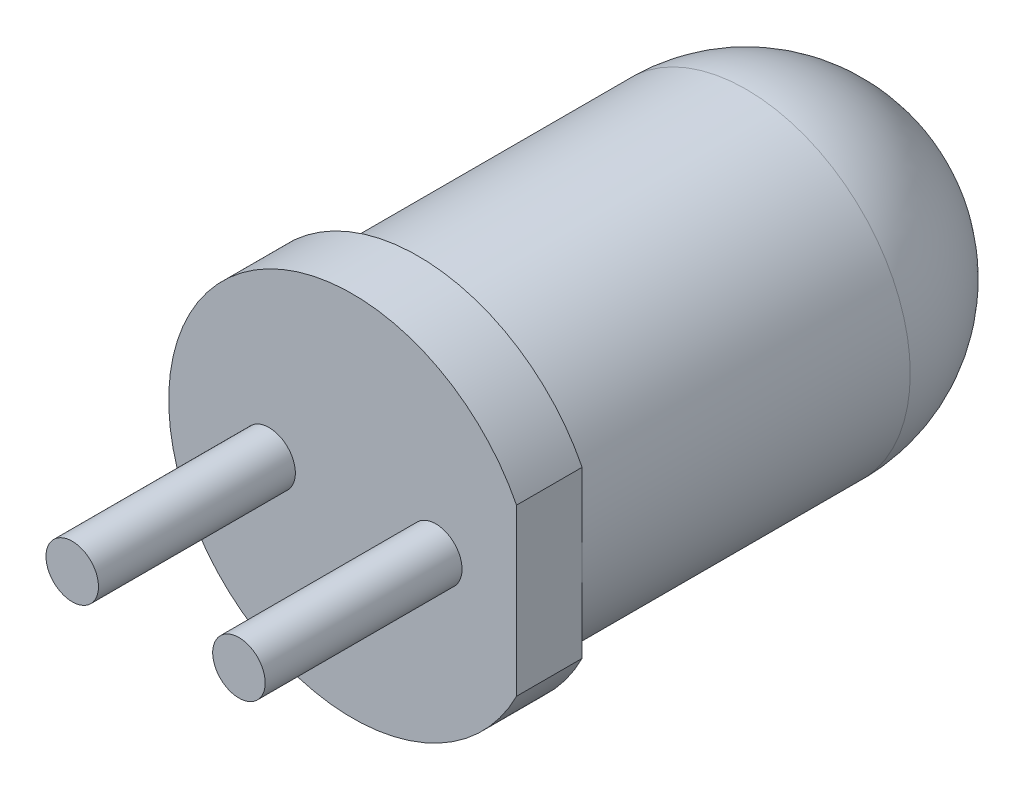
from build123d import *

# Parameters (mm, degrees)
ESQUISSE1_R          = 2.5
BASE_EXTRUSION_DEPTH = 8.5
BOSS_EXTRU_1_DEPTH   = 1
CONG_1_R             = 2.5
ESQUISSE3_R          = 0.4
EXTRUSION1_DEPTH     = 3


with BuildPart() as part:
    # Esquisse1 → Base-Extrusion (new body)
    with BuildSketch(Plane.XY):
        Circle(ESQUISSE1_R)
    extrude(amount=BASE_EXTRUSION_DEPTH)

    # Esquisse2 → Boss.-Extru.1 (add)
    with BuildSketch(Plane.XY.offset(8.5)):
        with BuildLine():
            Line((2.5, 1.260952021), (2.5, -1.260952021))
            ThreePointArc((2.5, -1.260952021), (-2.8, 0), (2.5, 1.260952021))
        make_face()
    extrude(amount=-BOSS_EXTRU_1_DEPTH)

    # Cong_1
    cong_1_edges = [part.edges().sort_by_distance(p)[0] for p in [
        (-2.5, 0, 0),
    ]]
    fillet(cong_1_edges, radius=CONG_1_R)

    # Esquisse3 → Extrusion1 (add)
    with BuildSketch(Plane.XY.offset(8.5)):
        with Locations((1.27, 0)):
            Circle(ESQUISSE3_R)
        with Locations(Location((-1.27, 0, 0), (0, 0, 180))):
            Circle(ESQUISSE3_R)
    extrude(amount=EXTRUSION1_DEPTH)


solid = part.part
